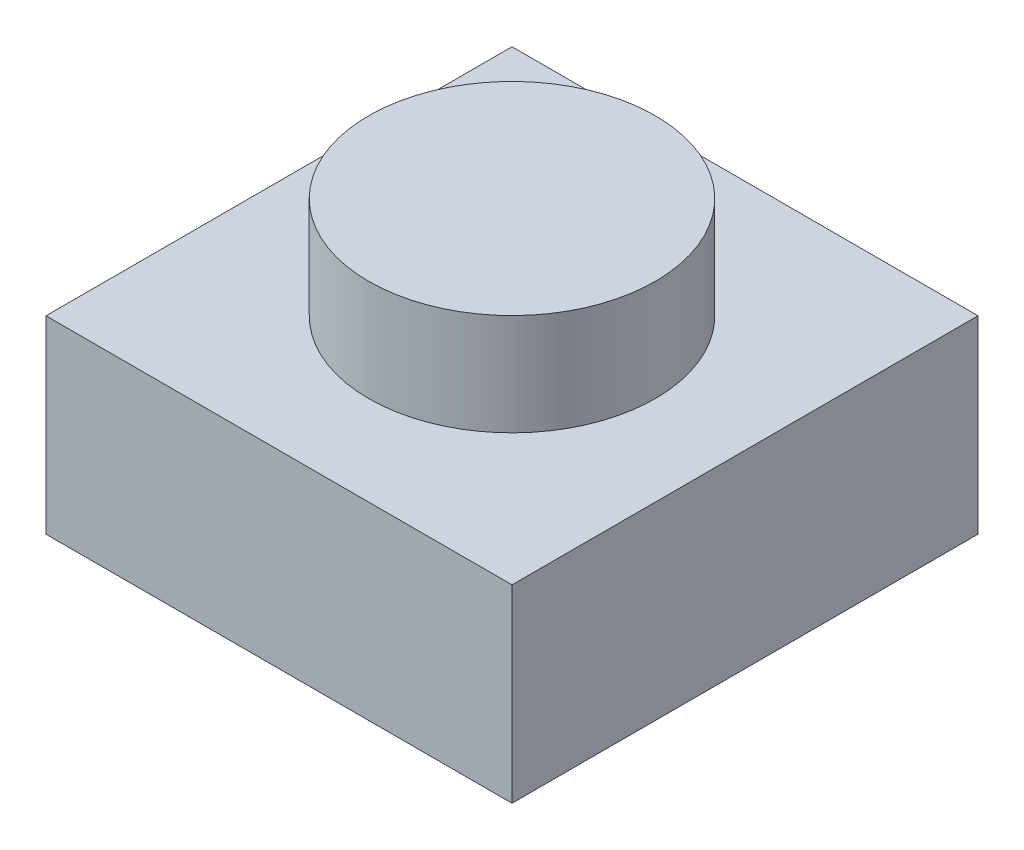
from build123d import *

# Parameters (mm, degrees)
SKETCH1_W      = 7.8
SKETCH1_H      = 7.8
EXTRUDE1_DEPTH = 3.166
SKETCH2_R      = 2.4
EXTRUDE2_DEPTH = 1.7
SKETCH3_W      = 4.9
SKETCH3_H      = 4.9
EXTRUDE3_DEPTH = 2.5


with BuildPart() as part:
    # Sketch1 → Extrude1 (new body)
    with BuildSketch(Plane(origin=(0, 0, 0), x_dir=(1, 0, 0), z_dir=(0, 1, 0))):
        Rectangle(SKETCH1_W, SKETCH1_H)
    extrude(amount=EXTRUDE1_DEPTH)

    # Sketch2 → Extrude2 (add)
    with BuildSketch(Plane(origin=(0, 3.166, 0), x_dir=(1, 0, 0), z_dir=(0, 1, 0))):
        with Locations(Location((0, 0, 0), (0, 0, 270))):
            Circle(SKETCH2_R)
    extrude(amount=EXTRUDE2_DEPTH)

    # Sketch3 → Extrude3 (cut)
    with BuildSketch(Plane.XZ):
        Rectangle(SKETCH3_W, SKETCH3_H)
    extrude(amount=-EXTRUDE3_DEPTH, mode=Mode.SUBTRACT)


solid = part.part
